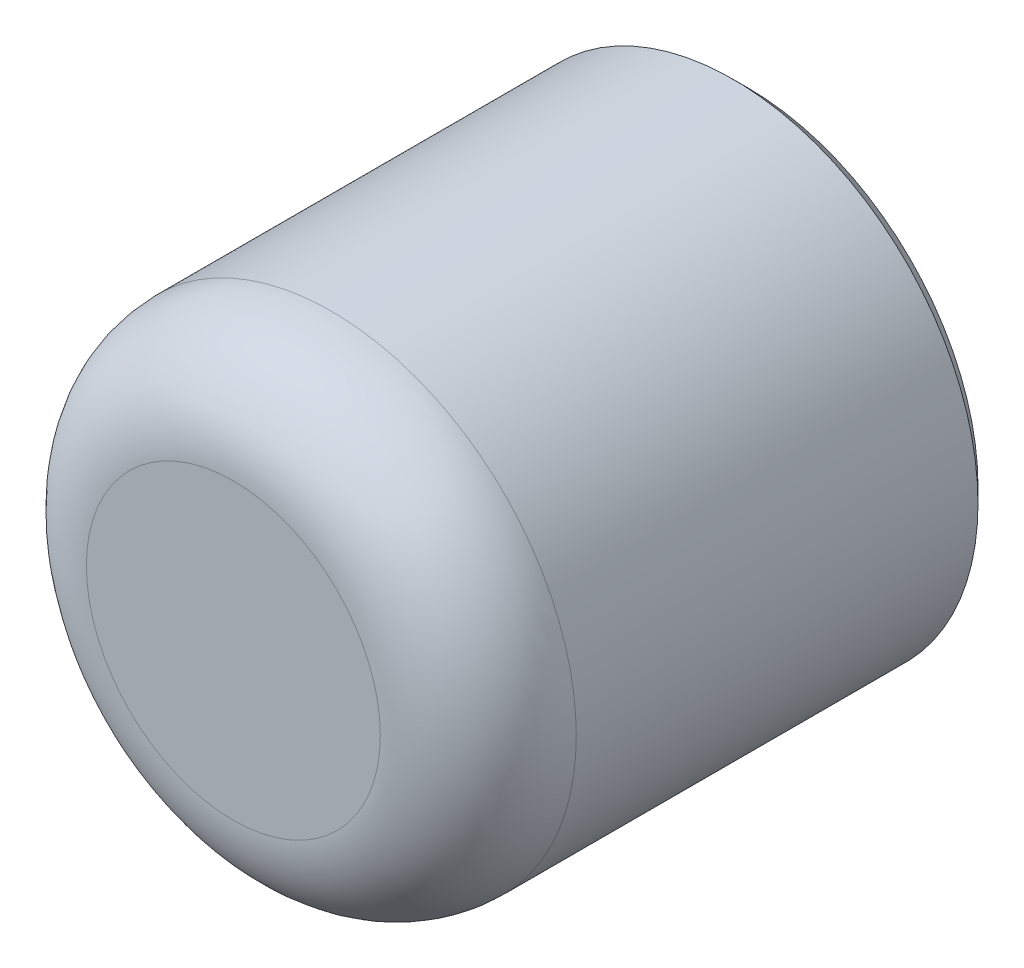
from build123d import *

# Parameters (mm, degrees)
SKETCH_1_R          = 5
EXTRUDE_1_DEPTH     = 8.5
HOLE_WIZARD_M8_2_D  = 6.8
SKETCH_6_R          = 5
EXTRUDE_2_DEPTH     = 2
FILLET_1_R          = 2
CHAMFER_1_SIZE      = 0.3
SKETCH_7_R          = 4
CUT_EXTRUDE_2_DEPTH = 1
CHAMFER_2_SIZE      = 0.2


with BuildPart() as part:
    # Sketch 1 → Extrude 1 (new body)
    with BuildSketch(Plane.XY):
        Circle(SKETCH_1_R)
    extrude(amount=EXTRUDE_1_DEPTH)

    # Hole Wizard M8 _2 (through all)
    with Locations(Plane(origin=(0, 0, 0), x_dir=(-1, 0, 0), z_dir=(0, 0, -1))):
        with Locations((0, 0)):
            Hole(HOLE_WIZARD_M8_2_D / 2)

    # Sketch 6 → Extrude 2 (add)
    with BuildSketch(Plane.XY.offset(8.5)):
        Circle(SKETCH_6_R)
    extrude(amount=EXTRUDE_2_DEPTH)

    # Fillet 1
    fillet_1_edges = [part.edges().sort_by_distance(p)[0] for p in [
        (-5, 0, 10.5),
    ]]
    fillet(fillet_1_edges, radius=FILLET_1_R)

    # Chamfer 1
    chamfer_1_edges = [part.edges().sort_by_distance(p)[0] for p in [
        (-5, 0, 0),
        (-3.4, 0, 0),
    ]]
    chamfer(chamfer_1_edges, length=CHAMFER_1_SIZE)

    # Sketch 7 → Cut-Extrude 2 (cut)
    with BuildSketch(Plane(origin=(0, 0, 8.5), x_dir=(-1, 0, 0), z_dir=(0, 0, -1))):
        Circle(SKETCH_7_R)
    extrude(amount=CUT_EXTRUDE_2_DEPTH, mode=Mode.SUBTRACT)

    # Chamfer 2
    chamfer_2_edges = [part.edges().sort_by_distance(p)[0] for p in [
        (-3.4, 0, 7.5),
    ]]
    chamfer(chamfer_2_edges, length=CHAMFER_2_SIZE)


solid = part.part
